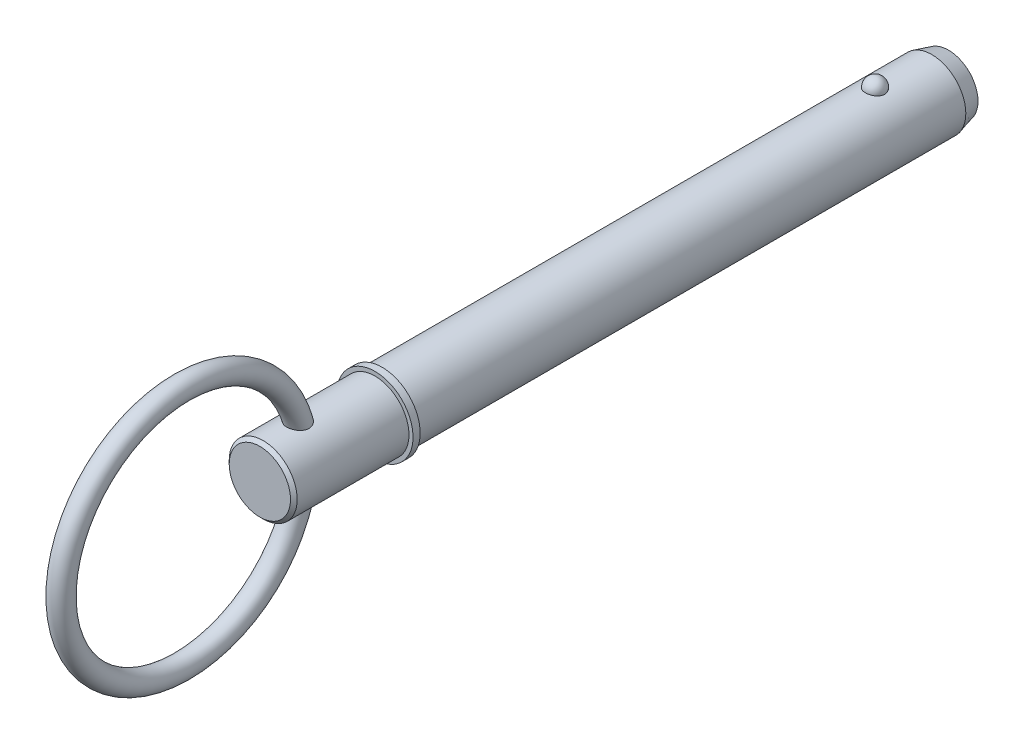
ISO-10303-21;
HEADER;
FILE_DESCRIPTION(('STEP AP214'),'2;1');
FILE_NAME('part.step','',(''),(''),'','','');
FILE_SCHEMA(('AUTOMOTIVE_DESIGN { 1 0 10303 214 1 1 1 1 }'));
ENDSEC;
DATA;
#1=APPLICATION_CONTEXT('core data for automotive mechanical design processes');
#2=APPLICATION_PROTOCOL_DEFINITION('international standard','automotive_design',2000,#1);
#3=PRODUCT_CONTEXT('',#1,'mechanical');
#4=PRODUCT('Part','Part','',(#3));
#5=PRODUCT_RELATED_PRODUCT_CATEGORY('part','',(#4));
#6=PRODUCT_DEFINITION_FORMATION('','',#4);
#7=PRODUCT_DEFINITION_CONTEXT('part definition',#1,'design');
#8=PRODUCT_DEFINITION('design','',#6,#7);
#9=PRODUCT_DEFINITION_SHAPE('','',#8);
#10=(LENGTH_UNIT() NAMED_UNIT(*) SI_UNIT(.MILLI.,.METRE.));
#11=(NAMED_UNIT(*) PLANE_ANGLE_UNIT() SI_UNIT($,.RADIAN.));
#12=(NAMED_UNIT(*) SI_UNIT($,.STERADIAN.) SOLID_ANGLE_UNIT());
#13=UNCERTAINTY_MEASURE_WITH_UNIT(LENGTH_MEASURE(1.E-05),#10,'distance_accuracy_value','');
#14=(GEOMETRIC_REPRESENTATION_CONTEXT(3) GLOBAL_UNCERTAINTY_ASSIGNED_CONTEXT((#13)) GLOBAL_UNIT_ASSIGNED_CONTEXT((#10,
#11,#12)) REPRESENTATION_CONTEXT('',''));
#15=CARTESIAN_POINT('',(0.,0.,0.));
#16=DIRECTION('',(0.,0.,1.));
#17=DIRECTION('',(1.,0.,0.));
#18=AXIS2_PLACEMENT_3D('',#15,#16,#17);
#19=CARTESIAN_POINT('',(0.,0.,101.6));
#20=DIRECTION('',(0.,0.,-1.));
#21=DIRECTION('',(-1.,0.,0.));
#22=AXIS2_PLACEMENT_3D('',#19,#20,#21);
#23=CYLINDRICAL_SURFACE('',#22,7.145);
#24=CARTESIAN_POINT('',(1.99971637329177,6.85945766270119,-2.02));
#25=CARTESIAN_POINT('',(1.9997145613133,6.85945924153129,-1.9070973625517));
#26=CARTESIAN_POINT('',(1.99051486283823,6.86216053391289,-1.79417185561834));
#27=CARTESIAN_POINT('',(1.95393597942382,6.87266409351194,-1.57152267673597));
#28=CARTESIAN_POINT('',(1.92655029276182,6.88046818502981,-1.46180016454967));
#29=CARTESIAN_POINT('',(1.85429435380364,6.90029063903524,-1.24873107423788));
#30=CARTESIAN_POINT('',(1.80943177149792,6.91230715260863,-1.14538172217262));
#31=CARTESIAN_POINT('',(1.70333474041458,6.93921158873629,-0.947875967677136));
#32=CARTESIAN_POINT('',(1.64210059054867,6.95409945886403,-0.853719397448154));
#33=CARTESIAN_POINT('',(1.5044381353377,6.98517577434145,-0.67672157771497));
#34=CARTESIAN_POINT('',(1.42793505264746,7.00137037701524,-0.593939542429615));
#35=CARTESIAN_POINT('',(1.26189697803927,7.03319066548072,-0.442536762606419));
#36=CARTESIAN_POINT('',(1.17236198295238,7.04881635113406,-0.37391602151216));
#37=CARTESIAN_POINT('',(0.982932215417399,7.0777121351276,-0.252935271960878));
#38=CARTESIAN_POINT('',(0.883068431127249,7.09098897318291,-0.200528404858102));
#39=CARTESIAN_POINT('',(0.675560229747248,7.11375589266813,-0.11321230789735));
#40=CARTESIAN_POINT('',(0.567916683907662,7.12324639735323,-0.0783011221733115));
#41=CARTESIAN_POINT('',(0.350006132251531,7.13724173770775,-0.02747075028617));
#42=CARTESIAN_POINT('',(0.239822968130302,7.14183447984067,-0.0112162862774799));
#43=CARTESIAN_POINT('',(0.0181946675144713,7.14583597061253,0.00296794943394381));
#44=CARTESIAN_POINT('',(-0.0932503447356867,7.14524522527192,0.000899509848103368));
#45=CARTESIAN_POINT('',(-0.312527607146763,7.13899247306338,-0.0213331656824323));
#46=CARTESIAN_POINT('',(-0.420388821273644,7.13340426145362,-0.0412340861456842));
#47=CARTESIAN_POINT('',(-0.631141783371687,7.11785474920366,-0.098204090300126));
#48=CARTESIAN_POINT('',(-0.734033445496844,7.10789337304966,-0.135273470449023));
#49=CARTESIAN_POINT('',(-0.932634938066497,7.08458058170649,-0.225826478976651));
#50=CARTESIAN_POINT('',(-1.02829911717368,7.07120963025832,-0.279405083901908));
#51=CARTESIAN_POINT('',(-1.20927180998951,7.04252043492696,-0.401457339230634));
#52=CARTESIAN_POINT('',(-1.29457925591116,7.02720199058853,-0.469932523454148));
#53=CARTESIAN_POINT('',(-1.45423311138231,6.995926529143,-0.621438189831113));
#54=CARTESIAN_POINT('',(-1.5283348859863,6.97996288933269,-0.704725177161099));
#55=CARTESIAN_POINT('',(-1.66169281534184,6.94942414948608,-0.882667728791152));
#56=CARTESIAN_POINT('',(-1.72094789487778,6.93484915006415,-0.977324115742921));
#57=CARTESIAN_POINT('',(-1.82375276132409,6.90853186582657,-1.17661373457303));
#58=CARTESIAN_POINT('',(-1.86711024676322,6.8968248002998,-1.28135093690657));
#59=CARTESIAN_POINT('',(-1.9360425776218,6.87779420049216,-1.4968998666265));
#60=CARTESIAN_POINT('',(-1.96161794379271,6.87047053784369,-1.60771141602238));
#61=CARTESIAN_POINT('',(-1.99427437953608,6.86106309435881,-1.83176258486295));
#62=CARTESIAN_POINT('',(-2.00143373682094,6.8589571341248,-1.9449898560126));
#63=CARTESIAN_POINT('',(-1.99730449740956,6.86016064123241,-2.17107603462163));
#64=CARTESIAN_POINT('',(-1.98601641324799,6.86346995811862,-2.28393495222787));
#65=CARTESIAN_POINT('',(-1.94538181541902,6.87509649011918,-2.5054843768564));
#66=CARTESIAN_POINT('',(-1.91612773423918,6.88338806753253,-2.61419321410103));
#67=CARTESIAN_POINT('',(-1.84036449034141,6.90402888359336,-2.82501243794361));
#68=CARTESIAN_POINT('',(-1.79385462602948,6.91637828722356,-2.92712255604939));
#69=CARTESIAN_POINT('',(-1.68442067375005,6.94384180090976,-3.12247704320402));
#70=CARTESIAN_POINT('',(-1.62140729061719,6.95897081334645,-3.21566929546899));
#71=CARTESIAN_POINT('',(-1.4806650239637,6.99026742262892,-3.38999412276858));
#72=CARTESIAN_POINT('',(-1.40293556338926,7.00643506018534,-3.47112622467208));
#73=CARTESIAN_POINT('',(-1.2344320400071,7.03807960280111,-3.61938672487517));
#74=CARTESIAN_POINT('',(-1.1436092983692,7.05355363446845,-3.68646046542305));
#75=CARTESIAN_POINT('',(-0.9515914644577,7.08201263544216,-3.80431973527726));
#76=CARTESIAN_POINT('',(-0.850397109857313,7.09499778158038,-3.85510642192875));
#77=CARTESIAN_POINT('',(-0.641823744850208,7.11687679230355,-3.93839532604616));
#78=CARTESIAN_POINT('',(-0.534539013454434,7.1258202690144,-3.9711204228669));
#79=CARTESIAN_POINT('',(-0.315743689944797,7.1388605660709,-4.01830716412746));
#80=CARTESIAN_POINT('',(-0.204233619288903,7.14295798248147,-4.03277105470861));
#81=CARTESIAN_POINT('',(0.0175518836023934,7.14582273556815,-4.04291389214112));
#82=CARTESIAN_POINT('',(0.127809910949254,7.14469090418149,-4.03894819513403));
#83=CARTESIAN_POINT('',(0.346044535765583,7.13745046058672,-4.01315850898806));
#84=CARTESIAN_POINT('',(0.454021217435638,7.13134203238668,-3.99133518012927));
#85=CARTESIAN_POINT('',(0.664227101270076,7.11483713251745,-3.93057164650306));
#86=CARTESIAN_POINT('',(0.766477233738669,7.10445761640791,-3.89169908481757));
#87=CARTESIAN_POINT('',(0.96292921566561,7.08050813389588,-3.79792023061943));
#88=CARTESIAN_POINT('',(1.05713054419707,7.06693796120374,-3.7430129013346));
#89=CARTESIAN_POINT('',(1.23644031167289,7.03780007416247,-3.61765173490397));
#90=CARTESIAN_POINT('',(1.32138387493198,7.0222044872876,-3.54696861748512));
#91=CARTESIAN_POINT('',(1.47830582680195,6.99085504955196,-3.39245228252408));
#92=CARTESIAN_POINT('',(1.55028198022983,6.97510117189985,-3.30861680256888));
#93=CARTESIAN_POINT('',(1.68063701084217,6.94485803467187,-3.12843058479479));
#94=CARTESIAN_POINT('',(1.73875175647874,6.93039619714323,-3.03188405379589));
#95=CARTESIAN_POINT('',(1.83823393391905,6.90467783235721,-2.83015210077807));
#96=CARTESIAN_POINT('',(1.87960712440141,6.89342020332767,-2.72496966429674));
#97=CARTESIAN_POINT('',(1.94111647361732,6.87633596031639,-2.52050234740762));
#98=CARTESIAN_POINT('',(1.96305249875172,6.87005682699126,-2.42179225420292));
#99=CARTESIAN_POINT('',(1.99235308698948,6.86161702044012,-2.22206084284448));
#100=CARTESIAN_POINT('',(1.99971799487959,6.85945624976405,-2.12103957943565));
#101=CARTESIAN_POINT('',(1.99971637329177,6.85945766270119,-2.02));
#102=B_SPLINE_CURVE_WITH_KNOTS('',3,(#24,#25,#26,#27,#28,#29,#30,#31,#32,#33,#34,#35,#36,#37,
#38,#39,#40,#41,#42,#43,#44,#45,#46,#47,#48,#49,#50,#51,#52,#53,#54,#55,#56,#57,#58,#59,#60,#61,
#62,#63,#64,#65,#66,#67,#68,#69,#70,#71,#72,#73,#74,#75,#76,#77,#78,#79,#80,#81,#82,#83,#84,#85,
#86,#87,#88,#89,#90,#91,#92,#93,#94,#95,#96,#97,#98,#99,#100,#101),.UNSPECIFIED.,.T.,.F.,(4,2,2,
2,2,2,2,2,2,2,2,2,2,2,2,2,2,2,2,2,2,2,2,2,2,2,2,2,2,2,2,2,2,2,2,2,2,2,4),(0.,0.338345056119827,
0.67681114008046,1.01512885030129,1.35344038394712,1.69345130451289,2.0334623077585,
2.37248128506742,2.71146235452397,3.04425125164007,3.37700766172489,3.70493009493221,
4.03285819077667,4.36270921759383,4.69259422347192,5.02887632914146,5.36518278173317,
5.70543263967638,6.04567253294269,6.38446363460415,6.72324532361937,7.0602984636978,
7.39736530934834,7.73629500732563,8.07523799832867,8.4154752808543,8.7556883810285,
9.09160363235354,9.42747756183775,9.75690239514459,10.0863150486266,10.4144324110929,
10.7425709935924,11.0758313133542,11.4091490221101,11.748385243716,12.0875046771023,
12.3903058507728,12.6930998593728),.UNSPECIFIED.);
#103=CARTESIAN_POINT('',(1.99971637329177,6.85945766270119,-2.02));
#104=VERTEX_POINT('',#103);
#105=EDGE_CURVE('E103',#104,#104,#102,.T.);
#106=ORIENTED_EDGE('',*,*,#105,.T.);
#107=EDGE_LOOP('',(#106));
#108=FACE_BOUND('',#107,.T.);
#109=CARTESIAN_POINT('',(0.,0.,-13.95));
#110=DIRECTION('',(0.,0.,-1.));
#111=DIRECTION('',(-1.,0.,0.));
#112=AXIS2_PLACEMENT_3D('',#109,#110,#111);
#113=CIRCLE('',#112,7.145);
#114=CARTESIAN_POINT('',(7.145,0.,-13.95));
#115=VERTEX_POINT('',#114);
#116=EDGE_CURVE('E111',#115,#115,#113,.F.);
#117=ORIENTED_EDGE('',*,*,#116,.T.);
#118=EDGE_LOOP('',(#117));
#119=FACE_BOUND('',#118,.T.);
#120=CARTESIAN_POINT('',(0.,0.,101.6));
#121=DIRECTION('',(0.,0.,1.));
#122=DIRECTION('',(1.,0.,0.));
#123=AXIS2_PLACEMENT_3D('',#120,#121,#122);
#124=CIRCLE('',#123,7.145);
#125=CARTESIAN_POINT('',(7.145,0.,101.6));
#126=VERTEX_POINT('',#125);
#127=EDGE_CURVE('E109',#126,#126,#124,.T.);
#128=ORIENTED_EDGE('',*,*,#127,.F.);
#129=EDGE_LOOP('',(#128));
#130=FACE_BOUND('',#129,.T.);
#131=ADVANCED_FACE('F39',(#108,#119,#130),#23,.T.);
#132=CARTESIAN_POINT('',(0.,0.,-17.45));
#133=DIRECTION('',(0.,0.,-1.));
#134=DIRECTION('',(-1.,0.,0.));
#135=AXIS2_PLACEMENT_3D('',#132,#133,#134);
#136=PLANE('',#135);
#137=CARTESIAN_POINT('',(0.,0.,-17.45));
#138=DIRECTION('',(0.,0.,-1.));
#139=DIRECTION('',(-1.,0.,0.));
#140=AXIS2_PLACEMENT_3D('',#137,#138,#139);
#141=CIRCLE('',#140,6.20717782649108);
#142=CARTESIAN_POINT('',(6.20717782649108,0.,-17.45));
#143=VERTEX_POINT('',#142);
#144=EDGE_CURVE('E143',#143,#143,#141,.T.);
#145=ORIENTED_EDGE('',*,*,#144,.T.);
#146=EDGE_LOOP('',(#145));
#147=FACE_BOUND('',#146,.T.);
#148=ADVANCED_FACE('F89',(#147),#136,.T.);
#149=CARTESIAN_POINT('',(0.,0.,-17.45));
#150=DIRECTION('',(0.,0.,1.));
#151=DIRECTION('',(1.,0.,0.));
#152=AXIS2_PLACEMENT_3D('',#149,#150,#151);
#153=CONICAL_SURFACE('',#152,6.20717782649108,0.261799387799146);
#154=CARTESIAN_POINT('',(7.145,0.,-13.95));
#155=CARTESIAN_POINT('',(7.13523101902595,0.,-13.9864583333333));
#156=CARTESIAN_POINT('',(7.1254620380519,0.,-14.0229166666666));
#157=CARTESIAN_POINT('',(7.1059240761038,0.,-14.0958333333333));
#158=CARTESIAN_POINT('',(7.09615509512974,0.,-14.1322916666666));
#159=CARTESIAN_POINT('',(7.07661713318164,0.,-14.2052083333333));
#160=CARTESIAN_POINT('',(7.06684815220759,0.,-14.2416666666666));
#161=CARTESIAN_POINT('',(7.04731019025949,0.,-14.3145833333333));
#162=CARTESIAN_POINT('',(7.03754120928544,0.,-14.3510416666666));
#163=CARTESIAN_POINT('',(7.01800324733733,0.,-14.4239583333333));
#164=CARTESIAN_POINT('',(7.00823426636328,0.,-14.4604166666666));
#165=CARTESIAN_POINT('',(6.98869630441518,0.,-14.5333333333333));
#166=CARTESIAN_POINT('',(6.97892732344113,0.,-14.5697916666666));
#167=CARTESIAN_POINT('',(6.95938936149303,0.,-14.6427083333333));
#168=CARTESIAN_POINT('',(6.94962038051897,0.,-14.6791666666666));
#169=CARTESIAN_POINT('',(6.93008241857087,0.,-14.7520833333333));
#170=CARTESIAN_POINT('',(6.92031343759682,0.,-14.7885416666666));
#171=CARTESIAN_POINT('',(6.90077547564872,0.,-14.8614583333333));
#172=CARTESIAN_POINT('',(6.89100649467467,0.,-14.8979166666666));
#173=CARTESIAN_POINT('',(6.87146853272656,0.,-14.9708333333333));
#174=CARTESIAN_POINT('',(6.86169955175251,0.,-15.0072916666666));
#175=CARTESIAN_POINT('',(6.84216158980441,0.,-15.0802083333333));
#176=CARTESIAN_POINT('',(6.83239260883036,0.,-15.1166666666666));
#177=CARTESIAN_POINT('',(6.81285464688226,0.,-15.1895833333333));
#178=CARTESIAN_POINT('',(6.80308566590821,0.,-15.2260416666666));
#179=CARTESIAN_POINT('',(6.7835477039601,0.,-15.2989583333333));
#180=CARTESIAN_POINT('',(6.77377872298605,0.,-15.3354166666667));
#181=CARTESIAN_POINT('',(6.75424076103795,0.,-15.4083333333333));
#182=CARTESIAN_POINT('',(6.7444717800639,0.,-15.4447916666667));
#183=CARTESIAN_POINT('',(6.7249338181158,0.,-15.5177083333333));
#184=CARTESIAN_POINT('',(6.71516483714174,0.,-15.5541666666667));
#185=CARTESIAN_POINT('',(6.69562687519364,0.,-15.6270833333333));
#186=CARTESIAN_POINT('',(6.68585789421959,0.,-15.6635416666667));
#187=CARTESIAN_POINT('',(6.66631993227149,0.,-15.7364583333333));
#188=CARTESIAN_POINT('',(6.65655095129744,0.,-15.7729166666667));
#189=CARTESIAN_POINT('',(6.63701298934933,0.,-15.8458333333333));
#190=CARTESIAN_POINT('',(6.62724400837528,0.,-15.8822916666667));
#191=CARTESIAN_POINT('',(6.60770604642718,0.,-15.9552083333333));
#192=CARTESIAN_POINT('',(6.59793706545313,0.,-15.9916666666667));
#193=CARTESIAN_POINT('',(6.57839910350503,0.,-16.0645833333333));
#194=CARTESIAN_POINT('',(6.56863012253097,0.,-16.1010416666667));
#195=CARTESIAN_POINT('',(6.54909216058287,0.,-16.1739583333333));
#196=CARTESIAN_POINT('',(6.53932317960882,0.,-16.2104166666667));
#197=CARTESIAN_POINT('',(6.51978521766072,0.,-16.2833333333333));
#198=CARTESIAN_POINT('',(6.51001623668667,0.,-16.3197916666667));
#199=CARTESIAN_POINT('',(6.49047827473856,0.,-16.3927083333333));
#200=CARTESIAN_POINT('',(6.48070929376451,0.,-16.4291666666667));
#201=CARTESIAN_POINT('',(6.46117133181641,0.,-16.5020833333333));
#202=CARTESIAN_POINT('',(6.45140235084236,0.,-16.5385416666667));
#203=CARTESIAN_POINT('',(6.43186438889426,0.,-16.6114583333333));
#204=CARTESIAN_POINT('',(6.42209540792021,0.,-16.6479166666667));
#205=CARTESIAN_POINT('',(6.4025574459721,0.,-16.7208333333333));
#206=CARTESIAN_POINT('',(6.39278846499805,0.,-16.7572916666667));
#207=CARTESIAN_POINT('',(6.37325050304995,0.,-16.8302083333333));
#208=CARTESIAN_POINT('',(6.3634815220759,0.,-16.8666666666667));
#209=CARTESIAN_POINT('',(6.3439435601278,0.,-16.9395833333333));
#210=CARTESIAN_POINT('',(6.33417457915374,0.,-16.9760416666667));
#211=CARTESIAN_POINT('',(6.31463661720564,0.,-17.0489583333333));
#212=CARTESIAN_POINT('',(6.30486763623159,0.,-17.0854166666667));
#213=CARTESIAN_POINT('',(6.28532967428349,0.,-17.1583333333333));
#214=CARTESIAN_POINT('',(6.27556069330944,0.,-17.1947916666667));
#215=CARTESIAN_POINT('',(6.25602273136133,0.,-17.2677083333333));
#216=CARTESIAN_POINT('',(6.24625375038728,0.,-17.3041666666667));
#217=CARTESIAN_POINT('',(6.22671578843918,0.,-17.3770833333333));
#218=CARTESIAN_POINT('',(6.21694680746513,0.,-17.4135416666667));
#219=CARTESIAN_POINT('',(6.20717782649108,0.,-17.45));
#220=B_SPLINE_CURVE_WITH_KNOTS('',3,(#154,#155,#156,#157,#158,#159,#160,#161,#162,#163,#164,
#165,#166,#167,#168,#169,#170,#171,#172,#173,#174,#175,#176,#177,#178,#179,#180,#181,#182,#183,
#184,#185,#186,#187,#188,#189,#190,#191,#192,#193,#194,#195,#196,#197,#198,#199,#200,#201,#202,
#203,#204,#205,#206,#207,#208,#209,#210,#211,#212,#213,#214,#215,#216,#217,#218,#219),
.UNSPECIFIED.,.F.,.F.,(4,2,2,2,2,2,2,2,2,2,2,2,2,2,2,2,2,2,2,2,2,2,2,2,2,2,2,2,2,2,2,2,4),(0.,
0.113233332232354,0.226466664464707,0.33969999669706,0.452933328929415,0.566166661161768,
0.679399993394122,0.792633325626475,0.905866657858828,1.01909999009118,1.13233332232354,
1.24556665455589,1.35879998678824,1.4720333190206,1.58526665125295,1.6984999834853,
1.81173331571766,1.92496664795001,2.03819998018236,2.15143331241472,2.26466664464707,
2.37789997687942,2.49113330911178,2.60436664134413,2.71759997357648,2.83083330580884,
2.94406663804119,3.05729997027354,3.1705333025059,3.28376663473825,3.39699996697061,
3.51023329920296,3.62346663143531),.UNSPECIFIED.);
#221=EDGE_CURVE('BSEAM95',#115,#143,#220,.T.);
#222=ORIENTED_EDGE('',*,*,#116,.F.);
#223=ORIENTED_EDGE('',*,*,#144,.F.);
#224=ORIENTED_EDGE('',*,*,#221,.T.);
#225=ORIENTED_EDGE('',*,*,#221,.F.);
#226=EDGE_LOOP('',(#222,#224,#223,#225));
#227=FACE_BOUND('',#226,.T.);
#228=ADVANCED_FACE('F95',(#227),#153,.T.);
#229=CARTESIAN_POINT('',(0.,7.145,-2.02));
#230=DIRECTION('',(0.,1.,0.));
#231=DIRECTION('',(0.,0.,1.));
#232=AXIS2_PLACEMENT_3D('',#229,#230,#231);
#233=SPHERICAL_SURFACE('',#232,2.02);
#234=ORIENTED_EDGE('',*,*,#105,.F.);
#235=EDGE_LOOP('',(#234));
#236=FACE_BOUND('',#235,.T.);
#237=ADVANCED_FACE('F114',(#236),#233,.T.);
#238=CARTESIAN_POINT('',(0.,0.,101.6));
#239=DIRECTION('',(0.,0.,-1.));
#240=DIRECTION('',(-1.,0.,0.));
#241=AXIS2_PLACEMENT_3D('',#238,#239,#240);
#242=PLANE('',#241);
#243=ORIENTED_EDGE('',*,*,#127,.T.);
#244=EDGE_LOOP('',(#243));
#245=FACE_BOUND('',#244,.T.);
#246=CARTESIAN_POINT('',(0.,0.,101.6));
#247=DIRECTION('',(0.,0.,-1.));
#248=DIRECTION('',(-1.,0.,0.));
#249=AXIS2_PLACEMENT_3D('',#246,#247,#248);
#250=CIRCLE('',#249,8.);
#251=CARTESIAN_POINT('',(-8.,0.,101.6));
#252=VERTEX_POINT('',#251);
#253=EDGE_CURVE('E110',#252,#252,#250,.T.);
#254=ORIENTED_EDGE('',*,*,#253,.T.);
#255=EDGE_LOOP('',(#254));
#256=FACE_BOUND('',#255,.T.);
#257=ADVANCED_FACE('F118',(#245,#256),#242,.T.);
#258=CARTESIAN_POINT('',(0.,0.,33.7287874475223));
#259=DIRECTION('',(0.,0.,-1.));
#260=DIRECTION('',(-1.,0.,0.));
#261=AXIS2_PLACEMENT_3D('',#258,#259,#260);
#262=CYLINDRICAL_SURFACE('',#261,8.);
#263=CARTESIAN_POINT('',(0.,0.,103.1));
#264=DIRECTION('',(0.,0.,-1.));
#265=DIRECTION('',(-1.,0.,0.));
#266=AXIS2_PLACEMENT_3D('',#263,#264,#265);
#267=CIRCLE('',#266,8.);
#268=CARTESIAN_POINT('',(-8.,0.,103.1));
#269=VERTEX_POINT('',#268);
#270=EDGE_CURVE('E135',#269,#269,#267,.T.);
#271=ORIENTED_EDGE('',*,*,#270,.T.);
#272=EDGE_LOOP('',(#271));
#273=FACE_BOUND('',#272,.T.);
#274=ORIENTED_EDGE('',*,*,#253,.F.);
#275=EDGE_LOOP('',(#274));
#276=FACE_BOUND('',#275,.T.);
#277=ADVANCED_FACE('F122',(#273,#276),#262,.T.);
#278=CARTESIAN_POINT('',(0.,8.,103.1));
#279=DIRECTION('',(0.,0.,1.));
#280=DIRECTION('',(1.,0.,0.));
#281=AXIS2_PLACEMENT_3D('',#278,#279,#280);
#282=PLANE('',#281);
#283=CARTESIAN_POINT('',(0.,0.,103.1));
#284=DIRECTION('',(0.,0.,1.));
#285=DIRECTION('',(1.,0.,0.));
#286=AXIS2_PLACEMENT_3D('',#283,#284,#285);
#287=CIRCLE('',#286,7.145);
#288=CARTESIAN_POINT('',(7.145,0.,103.1));
#289=VERTEX_POINT('',#288);
#290=EDGE_CURVE('E113',#289,#289,#287,.T.);
#291=ORIENTED_EDGE('',*,*,#290,.F.);
#292=EDGE_LOOP('',(#291));
#293=FACE_BOUND('',#292,.T.);
#294=ORIENTED_EDGE('',*,*,#270,.F.);
#295=EDGE_LOOP('',(#294));
#296=FACE_BOUND('',#295,.T.);
#297=ADVANCED_FACE('F86',(#293,#296),#282,.T.);
#298=CARTESIAN_POINT('',(0.,0.,127.3));
#299=DIRECTION('',(0.,0.,-1.));
#300=DIRECTION('',(-1.,0.,0.));
#301=AXIS2_PLACEMENT_3D('',#298,#299,#300);
#302=CYLINDRICAL_SURFACE('',#301,7.145);
#303=CARTESIAN_POINT('',(-1.03551034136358,-7.0695645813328,117.230259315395));
#304=CARTESIAN_POINT('',(-0.923225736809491,-7.08601142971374,117.174402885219));
#305=CARTESIAN_POINT('',(-0.806039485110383,-7.10042113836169,117.127835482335));
#306=CARTESIAN_POINT('',(-0.565173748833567,-7.1236385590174,117.054279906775));
#307=CARTESIAN_POINT('',(-0.441495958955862,-7.13244772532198,117.027286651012));
#308=CARTESIAN_POINT('',(-0.191106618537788,-7.14354309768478,116.993450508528));
#309=CARTESIAN_POINT('',(-0.064394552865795,-7.14582818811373,116.986611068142));
#310=CARTESIAN_POINT('',(0.188443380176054,-7.14363337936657,116.993241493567));
#311=CARTESIAN_POINT('',(0.314569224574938,-7.13915321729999,117.006712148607));
#312=CARTESIAN_POINT('',(0.562499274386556,-7.12390574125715,117.05364165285));
#313=CARTESIAN_POINT('',(0.684308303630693,-7.11314569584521,117.087077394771));
#314=CARTESIAN_POINT('',(0.920329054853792,-7.08647538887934,117.173194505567));
#315=CARTESIAN_POINT('',(1.03454038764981,-7.07056486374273,117.225876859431));
#316=CARTESIAN_POINT('',(1.25232634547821,-7.03526161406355,117.3494470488));
#317=CARTESIAN_POINT('',(1.35588248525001,-7.01586299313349,117.42036580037));
#318=CARTESIAN_POINT('',(1.54916093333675,-6.9757352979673,117.578757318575));
#319=CARTESIAN_POINT('',(1.63888414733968,-6.95500631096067,117.666229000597));
#320=CARTESIAN_POINT('',(1.80113983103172,-6.91475703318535,117.854727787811));
#321=CARTESIAN_POINT('',(1.8738192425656,-6.89522757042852,117.955626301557));
#322=CARTESIAN_POINT('',(2.00091178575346,-6.85942834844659,118.16884010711));
#323=CARTESIAN_POINT('',(2.05532963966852,-6.8431577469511,118.281152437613));
#324=CARTESIAN_POINT('',(2.14350100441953,-6.81604873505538,118.511194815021));
#325=CARTESIAN_POINT('',(2.17770329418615,-6.80509340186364,118.628739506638));
#326=CARTESIAN_POINT('',(2.22691394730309,-6.7891497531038,118.868149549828));
#327=CARTESIAN_POINT('',(2.2419216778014,-6.7841616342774,118.990015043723));
#328=CARTESIAN_POINT('',(2.25313992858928,-6.78044381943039,119.23580699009));
#329=CARTESIAN_POINT('',(2.24917302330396,-6.78177319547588,119.359742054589));
#330=CARTESIAN_POINT('',(2.22301329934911,-6.79039131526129,119.605438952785));
#331=CARTESIAN_POINT('',(2.20081491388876,-6.79768187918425,119.7272001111));
#332=CARTESIAN_POINT('',(2.13702421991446,-6.81801706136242,119.975287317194));
#333=CARTESIAN_POINT('',(2.09404815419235,-6.83146790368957,120.101223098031));
#334=CARTESIAN_POINT('',(1.9898638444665,-6.86253672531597,120.344824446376));
#335=CARTESIAN_POINT('',(1.9286413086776,-6.88015796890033,120.462483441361));
#336=CARTESIAN_POINT('',(1.78274362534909,-6.91947130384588,120.697497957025));
#337=CARTESIAN_POINT('',(1.69640701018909,-6.94139021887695,120.813789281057));
#338=CARTESIAN_POINT('',(1.50503944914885,-6.98537683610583,121.029799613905));
#339=CARTESIAN_POINT('',(1.40001969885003,-7.00744444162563,121.129528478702));
#340=CARTESIAN_POINT('',(1.19221781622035,-7.04548349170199,121.293170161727));
#341=CARTESIAN_POINT('',(1.09203347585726,-7.06185586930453,121.36028599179));
#342=CARTESIAN_POINT('',(0.881607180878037,-7.09119477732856,121.477337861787));
#343=CARTESIAN_POINT('',(0.771372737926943,-7.10416382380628,121.527286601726));
#344=CARTESIAN_POINT('',(0.542622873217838,-7.12529560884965,121.607475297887));
#345=CARTESIAN_POINT('',(0.424058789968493,-7.13342692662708,121.63758654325));
#346=CARTESIAN_POINT('',(0.18315568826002,-7.14366628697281,121.675370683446));
#347=CARTESIAN_POINT('',(0.0608191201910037,-7.14577815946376,121.683057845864));
#348=CARTESIAN_POINT('',(-0.169367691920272,-7.14381572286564,121.675860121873));
#349=CARTESIAN_POINT('',(-0.277308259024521,-7.14040669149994,121.663402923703));
#350=CARTESIAN_POINT('',(-0.489468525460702,-7.12900651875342,121.621156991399));
#351=CARTESIAN_POINT('',(-0.593687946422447,-7.12101503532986,121.591366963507));
#352=CARTESIAN_POINT('',(-0.79614963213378,-7.10123695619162,121.515987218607));
#353=CARTESIAN_POINT('',(-0.894373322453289,-7.08943921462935,121.470351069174));
#354=CARTESIAN_POINT('',(-1.08274371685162,-7.06312621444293,121.365336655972));
#355=CARTESIAN_POINT('',(-1.17288754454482,-7.04860999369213,121.305953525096));
#356=CARTESIAN_POINT('',(-1.35484961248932,-7.01605385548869,121.167113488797));
#357=CARTESIAN_POINT('',(-1.44541008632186,-6.99780069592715,121.086061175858));
#358=CARTESIAN_POINT('',(-1.61364655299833,-6.96093393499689,120.911599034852));
#359=CARTESIAN_POINT('',(-1.69131381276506,-6.94232009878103,120.818180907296));
#360=CARTESIAN_POINT('',(-1.843300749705,-6.90364386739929,120.606608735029));
#361=CARTESIAN_POINT('',(-1.9154309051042,-6.88377370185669,120.486839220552));
#362=CARTESIAN_POINT('',(-2.04002946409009,-6.84788436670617,120.236875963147));
#363=CARTESIAN_POINT('',(-2.09248830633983,-6.83186707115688,120.106677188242));
#364=CARTESIAN_POINT('',(-2.17795964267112,-6.80511869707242,119.832555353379));
#365=CARTESIAN_POINT('',(-2.20992909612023,-6.79467512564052,119.688274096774));
#366=CARTESIAN_POINT('',(-2.24813111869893,-6.78213595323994,119.395984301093));
#367=CARTESIAN_POINT('',(-2.25438316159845,-6.78003403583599,119.247978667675));
#368=CARTESIAN_POINT('',(-2.24011368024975,-6.78475868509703,118.965430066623));
#369=CARTESIAN_POINT('',(-2.22172362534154,-6.79087455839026,118.830769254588));
#370=CARTESIAN_POINT('',(-2.16145328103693,-6.81029672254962,118.567367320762));
#371=CARTESIAN_POINT('',(-2.11958615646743,-6.82359898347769,118.438622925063));
#372=CARTESIAN_POINT('',(-2.0178412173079,-6.85433303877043,118.202267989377));
#373=CARTESIAN_POINT('',(-1.95982394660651,-6.87131080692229,118.093792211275));
#374=CARTESIAN_POINT('',(-1.82642155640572,-6.90796511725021,117.888591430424));
#375=CARTESIAN_POINT('',(-1.75103235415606,-6.92764229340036,117.791869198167));
#376=CARTESIAN_POINT('',(-1.57825515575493,-6.96911949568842,117.605408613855));
#377=CARTESIAN_POINT('',(-1.47957996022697,-6.99096237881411,117.51687037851));
#378=CARTESIAN_POINT('',(-1.26760341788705,-7.0324852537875,117.358840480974));
#379=CARTESIAN_POINT('',(-1.15429989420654,-7.05216492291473,117.289351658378));
#380=CARTESIAN_POINT('',(-1.03551034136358,-7.0695645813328,117.230259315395));
#381=B_SPLINE_CURVE_WITH_KNOTS('',3,(#303,#304,#305,#306,#307,#308,#309,#310,#311,#312,#313,
#314,#315,#316,#317,#318,#319,#320,#321,#322,#323,#324,#325,#326,#327,#328,#329,#330,#331,#332,
#333,#334,#335,#336,#337,#338,#339,#340,#341,#342,#343,#344,#345,#346,#347,#348,#349,#350,#351,
#352,#353,#354,#355,#356,#357,#358,#359,#360,#361,#362,#363,#364,#365,#366,#367,#368,#369,#370,
#371,#372,#373,#374,#375,#376,#377,#378,#379,#380),.UNSPECIFIED.,.T.,.F.,(4,2,2,2,2,2,2,2,2,2,2,
2,2,2,2,2,2,2,2,2,2,2,2,2,2,2,2,2,2,2,2,2,2,2,2,2,2,2,4),(0.,0.378979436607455,
0.757860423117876,1.13680619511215,1.51576669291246,1.89428943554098,2.2728315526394,
2.65201969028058,3.03118299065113,3.4069461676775,3.78261210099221,4.14959041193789,
4.5165808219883,4.88700951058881,5.25755134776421,5.65713708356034,6.05703662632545,
6.49445595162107,6.93161403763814,7.29520224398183,7.65852089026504,8.02417421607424,
8.38959483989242,8.71415763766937,9.03874466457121,9.36429093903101,9.68995264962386,
10.0572255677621,10.4247462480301,10.8465602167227,11.2685789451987,11.7106604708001,
12.152407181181,12.5583067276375,12.9639788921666,13.3347314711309,13.7055712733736,
14.1064462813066,14.5073810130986),.UNSPECIFIED.);
#382=CARTESIAN_POINT('',(-1.03551034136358,-7.0695645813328,117.230259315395));
#383=VERTEX_POINT('',#382);
#384=EDGE_CURVE('E10',#383,#383,#381,.T.);
#385=ORIENTED_EDGE('',*,*,#384,.F.);
#386=EDGE_LOOP('',(#385));
#387=FACE_BOUND('',#386,.T.);
#388=CARTESIAN_POINT('',(-1.03551034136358,7.0695645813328,117.230259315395));
#389=CARTESIAN_POINT('',(-1.14644953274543,7.0533145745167,117.285446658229));
#390=CARTESIAN_POINT('',(-1.25260902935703,7.03507806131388,117.349702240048));
#391=CARTESIAN_POINT('',(-1.45240021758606,6.99656564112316,117.494958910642));
#392=CARTESIAN_POINT('',(-1.54602879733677,6.97628922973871,117.575964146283));
#393=CARTESIAN_POINT('',(-1.71815091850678,6.93590796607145,117.752910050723));
#394=CARTESIAN_POINT('',(-1.79663177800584,6.91580327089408,117.848863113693));
#395=CARTESIAN_POINT('',(-1.93607718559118,6.87807159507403,118.053162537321));
#396=CARTESIAN_POINT('',(-1.99704642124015,6.86044395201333,118.161505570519));
#397=CARTESIAN_POINT('',(-2.09894945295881,6.82995115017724,118.385542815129));
#398=CARTESIAN_POINT('',(-2.1402125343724,6.81700866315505,118.501076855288));
#399=CARTESIAN_POINT('',(-2.20347311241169,6.79682602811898,118.737758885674));
#400=CARTESIAN_POINT('',(-2.22547114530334,6.78958572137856,118.858906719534));
#401=CARTESIAN_POINT('',(-2.25026114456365,6.78140983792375,119.103214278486));
#402=CARTESIAN_POINT('',(-2.25306986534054,6.78046876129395,119.22637215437));
#403=CARTESIAN_POINT('',(-2.2403056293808,6.78469532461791,119.471604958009));
#404=CARTESIAN_POINT('',(-2.22472720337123,6.78986478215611,119.593679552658));
#405=CARTESIAN_POINT('',(-2.17472134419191,6.8060520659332,119.842036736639));
#406=CARTESIAN_POINT('',(-2.13910164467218,6.81743831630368,119.968053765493));
#407=CARTESIAN_POINT('',(-2.04975058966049,6.84483151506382,120.212973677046));
#408=CARTESIAN_POINT('',(-1.99600968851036,6.86084089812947,120.331872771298));
#409=CARTESIAN_POINT('',(-1.86558545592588,6.8975101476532,120.571425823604));
#410=CARTESIAN_POINT('',(-1.78715729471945,6.91847353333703,120.691087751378));
#411=CARTESIAN_POINT('',(-1.61149373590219,6.96148580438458,120.915646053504));
#412=CARTESIAN_POINT('',(-1.51424701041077,6.98353533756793,121.02053346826));
#413=CARTESIAN_POINT('',(-1.30107590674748,7.02639179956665,121.212951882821));
#414=CARTESIAN_POINT('',(-1.18492282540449,7.04717858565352,121.300236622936));
#415=CARTESIAN_POINT('',(-0.937392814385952,7.08434208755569,121.450827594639));
#416=CARTESIAN_POINT('',(-0.806039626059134,7.10072555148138,121.514170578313));
#417=CARTESIAN_POINT('',(-0.550470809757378,7.12475629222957,121.605483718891));
#418=CARTESIAN_POINT('',(-0.427643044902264,7.13327781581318,121.637047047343));
#419=CARTESIAN_POINT('',(-0.240556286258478,7.14122488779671,121.666356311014));
#420=CARTESIAN_POINT('',(-0.177714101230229,7.14306799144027,121.673119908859));
#421=CARTESIAN_POINT('',(-0.0516470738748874,7.14509121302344,121.680539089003));
#422=CARTESIAN_POINT('',(0.0115777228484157,7.14527152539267,121.681195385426));
#423=CARTESIAN_POINT('',(0.182932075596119,7.14347436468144,121.674616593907));
#424=CARTESIAN_POINT('',(0.290871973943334,7.13986325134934,121.661408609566));
#425=CARTESIAN_POINT('',(0.502842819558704,7.1280769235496,121.617690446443));
#426=CARTESIAN_POINT('',(0.606873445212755,7.11990133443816,121.587178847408));
#427=CARTESIAN_POINT('',(0.809001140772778,7.09978218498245,121.510378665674));
#428=CARTESIAN_POINT('',(0.907071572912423,7.08782300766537,121.464024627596));
#429=CARTESIAN_POINT('',(1.09503957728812,7.0612282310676,121.357620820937));
#430=CARTESIAN_POINT('',(1.18493426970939,7.04659169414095,121.297566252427));
#431=CARTESIAN_POINT('',(1.36644041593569,7.01380352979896,121.157233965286));
#432=CARTESIAN_POINT('',(1.45676563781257,6.99544216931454,121.075344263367));
#433=CARTESIAN_POINT('',(1.6244063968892,6.95842750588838,120.899231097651));
#434=CARTESIAN_POINT('',(1.70171298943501,6.93977401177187,120.804999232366));
#435=CARTESIAN_POINT('',(1.85271606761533,6.90111647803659,120.591807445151));
#436=CARTESIAN_POINT('',(1.92421731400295,6.88131605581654,120.471248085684));
#437=CARTESIAN_POINT('',(2.04739198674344,6.84567995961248,120.219785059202));
#438=CARTESIAN_POINT('',(2.0990562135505,6.82984612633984,120.088876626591));
#439=CARTESIAN_POINT('',(2.1825776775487,6.80363167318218,119.813847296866));
#440=CARTESIAN_POINT('',(2.21345394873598,6.79352430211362,119.669397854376));
#441=CARTESIAN_POINT('',(2.24941288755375,6.78170753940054,119.376984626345));
#442=CARTESIAN_POINT('',(2.2545156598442,6.77999160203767,119.229023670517));
#443=CARTESIAN_POINT('',(2.2380435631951,6.78544298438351,118.947053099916));
#444=CARTESIAN_POINT('',(2.21864521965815,6.79188566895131,118.812903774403));
#445=CARTESIAN_POINT('',(2.1564876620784,6.81187529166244,118.550690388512));
#446=CARTESIAN_POINT('',(2.11373989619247,6.82541874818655,118.42262337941));
#447=CARTESIAN_POINT('',(2.01040099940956,6.85652522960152,118.187507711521));
#448=CARTESIAN_POINT('',(1.9516260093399,6.87365110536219,118.079597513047));
#449=CARTESIAN_POINT('',(1.81683142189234,6.91050025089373,117.875649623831));
#450=CARTESIAN_POINT('',(1.74081238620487,6.93022343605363,117.779611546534));
#451=CARTESIAN_POINT('',(1.57431234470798,6.96992220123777,117.60254183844));
#452=CARTESIAN_POINT('',(1.48394688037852,6.98989467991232,117.521400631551));
#453=CARTESIAN_POINT('',(1.29081365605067,7.02812243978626,117.375038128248));
#454=CARTESIAN_POINT('',(1.18804491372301,7.04637758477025,117.309818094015));
#455=CARTESIAN_POINT('',(0.970386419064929,7.07967210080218,117.195377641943));
#456=CARTESIAN_POINT('',(0.855272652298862,7.09462807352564,117.146558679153));
#457=CARTESIAN_POINT('',(0.618143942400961,7.11920826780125,117.068071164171));
#458=CARTESIAN_POINT('',(0.496128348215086,7.12883198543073,117.038404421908));
#459=CARTESIAN_POINT('',(0.247581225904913,7.14180209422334,116.998698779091));
#460=CARTESIAN_POINT('',(0.12102076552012,7.14509609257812,116.988823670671));
#461=CARTESIAN_POINT('',(-0.132022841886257,7.14489967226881,116.989415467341));
#462=CARTESIAN_POINT('',(-0.258506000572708,7.14141109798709,116.999876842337));
#463=CARTESIAN_POINT('',(-0.496649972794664,7.12862600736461,117.039053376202));
#464=CARTESIAN_POINT('',(-0.608625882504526,7.11987587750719,117.066055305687));
#465=CARTESIAN_POINT('',(-0.826925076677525,7.09783467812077,117.136222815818));
#466=CARTESIAN_POINT('',(-0.933248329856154,7.08454358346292,117.179388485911));
#467=CARTESIAN_POINT('',(-1.03551034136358,7.0695645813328,117.230259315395));
#468=B_SPLINE_CURVE_WITH_KNOTS('',3,(#388,#389,#390,#391,#392,#393,#394,#395,#396,#397,#398,
#399,#400,#401,#402,#403,#404,#405,#406,#407,#408,#409,#410,#411,#412,#413,#414,#415,#416,#417,
#418,#419,#420,#421,#422,#423,#424,#425,#426,#427,#428,#429,#430,#431,#432,#433,#434,#435,#436,
#437,#438,#439,#440,#441,#442,#443,#444,#445,#446,#447,#448,#449,#450,#451,#452,#453,#454,#455,
#456,#457,#458,#459,#460,#461,#462,#463,#464,#465,#466,#467),.UNSPECIFIED.,.T.,.F.,(4,2,2,2,2,2,
2,2,2,2,2,2,2,2,2,2,2,2,2,2,2,2,2,2,2,2,2,2,2,2,2,2,2,2,2,2,2,2,2,4),(0.,0.374504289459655,
0.749101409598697,1.12401080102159,1.49881974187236,1.86712525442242,2.23542051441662,
2.60339417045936,2.97147730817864,3.36420696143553,3.75714381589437,4.18898920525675,
4.62109535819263,5.05888124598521,5.49599234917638,5.87475353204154,6.0641680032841,
6.25356032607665,6.57826179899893,6.90298992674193,7.22907626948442,7.55527703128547,
7.92373585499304,8.29244681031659,8.71527472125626,9.13829848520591,9.5800990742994,
10.0215549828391,10.4264139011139,10.831074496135,11.2014904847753,11.571894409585,
11.9394538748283,12.3070424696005,12.6830655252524,13.0591241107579,13.4382822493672,
13.8173372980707,14.1625475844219,14.5077597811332),.UNSPECIFIED.);
#469=CARTESIAN_POINT('',(-1.03551034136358,7.0695645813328,117.230259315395));
#470=VERTEX_POINT('',#469);
#471=EDGE_CURVE('E51',#470,#470,#468,.T.);
#472=ORIENTED_EDGE('',*,*,#471,.F.);
#473=EDGE_LOOP('',(#472));
#474=FACE_BOUND('',#473,.T.);
#475=CARTESIAN_POINT('',(0.,0.,126.6));
#476=DIRECTION('',(0.,0.,-1.));
#477=DIRECTION('',(-1.,0.,0.));
#478=AXIS2_PLACEMENT_3D('',#475,#476,#477);
#479=CIRCLE('',#478,7.145);
#480=CARTESIAN_POINT('',(-7.145,0.,126.6));
#481=VERTEX_POINT('',#480);
#482=EDGE_CURVE('E65',#481,#481,#479,.T.);
#483=ORIENTED_EDGE('',*,*,#482,.T.);
#484=EDGE_LOOP('',(#483));
#485=FACE_BOUND('',#484,.T.);
#486=ORIENTED_EDGE('',*,*,#290,.T.);
#487=EDGE_LOOP('',(#486));
#488=FACE_BOUND('',#487,.T.);
#489=ADVANCED_FACE('F70',(#387,#474,#485,#488),#302,.T.);
#490=CARTESIAN_POINT('',(0.,0.,127.3));
#491=DIRECTION('',(0.,0.,-1.));
#492=DIRECTION('',(-1.,0.,0.));
#493=AXIS2_PLACEMENT_3D('',#490,#491,#492);
#494=PLANE('',#493);
#495=CARTESIAN_POINT('',(0.,0.,127.3));
#496=DIRECTION('',(0.,0.,-1.));
#497=DIRECTION('',(-1.,0.,0.));
#498=AXIS2_PLACEMENT_3D('',#495,#496,#497);
#499=CIRCLE('',#498,6.44499999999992);
#500=CARTESIAN_POINT('',(-6.44499999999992,0.,127.3));
#501=VERTEX_POINT('',#500);
#502=EDGE_CURVE('E58',#501,#501,#499,.F.);
#503=ORIENTED_EDGE('',*,*,#502,.T.);
#504=EDGE_LOOP('',(#503));
#505=FACE_BOUND('',#504,.T.);
#506=ADVANCED_FACE('F77',(#505),#494,.F.);
#507=CARTESIAN_POINT('',(0.,0.,126.6));
#508=DIRECTION('',(0.,0.,-1.));
#509=DIRECTION('',(-1.,0.,0.));
#510=AXIS2_PLACEMENT_3D('',#507,#508,#509);
#511=CONICAL_SURFACE('',#510,7.145,0.78539816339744);
#512=ORIENTED_EDGE('',*,*,#502,.F.);
#513=EDGE_LOOP('',(#512));
#514=FACE_BOUND('',#513,.T.);
#515=ORIENTED_EDGE('',*,*,#482,.F.);
#516=EDGE_LOOP('',(#515));
#517=FACE_BOUND('',#516,.T.);
#518=ADVANCED_FACE('F41',(#514,#517),#511,.T.);
#519=CARTESIAN_POINT('',(0.,0.,143.7));
#520=DIRECTION('',(1.,0.,0.));
#521=DIRECTION('',(0.,0.,-1.));
#522=AXIS2_PLACEMENT_3D('',#519,#520,#521);
#523=TOROIDAL_SURFACE('',#522,25.4,2.25);
#524=ORIENTED_EDGE('',*,*,#384,.T.);
#525=EDGE_LOOP('',(#524));
#526=FACE_BOUND('',#525,.T.);
#527=ORIENTED_EDGE('',*,*,#471,.T.);
#528=EDGE_LOOP('',(#527));
#529=FACE_BOUND('',#528,.T.);
#530=ADVANCED_FACE('F74',(#526,#529),#523,.T.);
#531=CLOSED_SHELL('',(#131,#148,#228,#237,#257,#277,#297,#489,#506,#518,#530));
#532=MANIFOLD_SOLID_BREP('B2',#531);
#533=ADVANCED_BREP_SHAPE_REPRESENTATION('',(#18,#532),#14);
#534=SHAPE_DEFINITION_REPRESENTATION(#9,#533);
ENDSEC;
END-ISO-10303-21;
